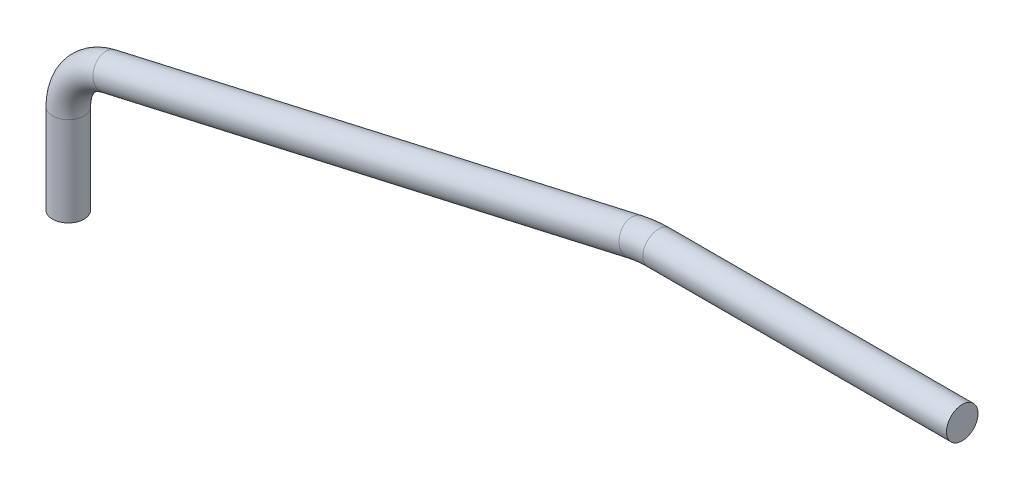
from build123d import *

# Parameters (mm, degrees)
ESQUISSE2_R = 3


with BuildPart() as part:
    # Base-Balayage: sweep along a path in Esquisse1
    with BuildLine(Plane.XY) as base_balayage_path:
        Line((-150, 0), (-150, 17.017714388))
        ThreePointArc((-150, 17.017714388), (-147.815436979, 23.256219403), (-142.216211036, 26.769042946))
        Line((-142.216211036, 26.769042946), (-42.18830869, 49.502657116))
        ThreePointArc((-42.18830869, 49.502657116), (-39.98600519, 49.875275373), (-37.755886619, 50))
        Line((-37.755886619, 50), (20, 50))
    # Esquisse2 → Base-Balayage (sweep)
    with BuildSketch(Plane(origin=(0, 0, 0), x_dir=(1, 0, 0), z_dir=(0, 1, 0))):
        with Locations((-150, 0)):
            Circle(ESQUISSE2_R)
    sweep(path=base_balayage_path.line)


solid = part.part
